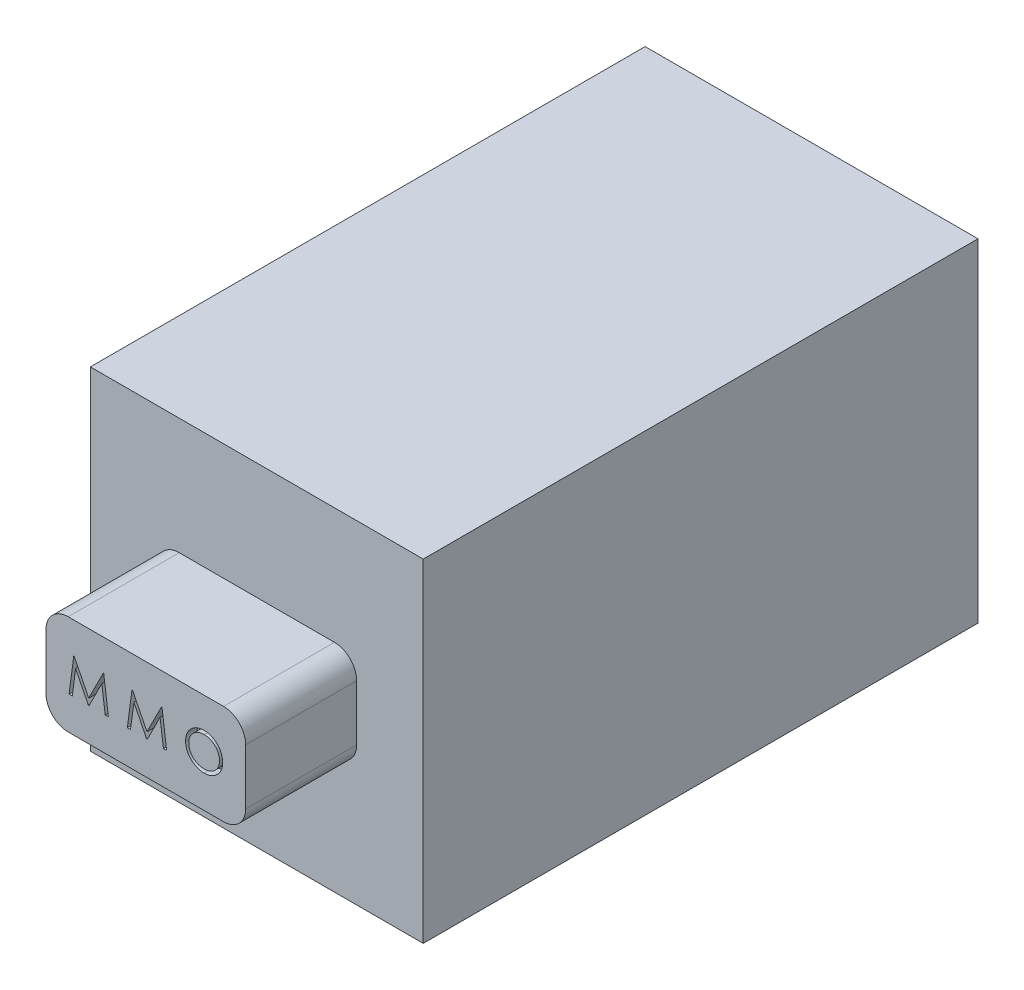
from build123d import *

# Parameters (mm, degrees)
ESQUISSE1_W             = 15
ESQUISSE1_H             = 15
BOSS_EXTRU_1_DEPTH      = 25
BOSS_EXTRU_2_DEPTH      = 5
ENL_V_MAT_EXTRU_1_DEPTH = 0.5


with BuildPart() as part:
    # Esquisse1 → Boss.-Extru.1 (new body)
    with BuildSketch(Plane.XY):
        Rectangle(ESQUISSE1_W, ESQUISSE1_H)
    extrude(amount=BOSS_EXTRU_1_DEPTH)

    # Esquisse2 → Boss.-Extru.2 (add)
    with BuildSketch(Plane.XY.offset(25)):
        with BuildLine():
            Line((-3.5, -2.25), (3.5, -2.25))
            ThreePointArc((3.5, -2.25), (4.207106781, -1.957106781), (4.5, -1.25))
            Line((4.5, -1.25), (4.5, 1.25))
            ThreePointArc((4.5, 1.25), (4.207106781, 1.957106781), (3.5, 2.25))
            Line((3.5, 2.25), (-3.5, 2.25))
            ThreePointArc((-3.5, 2.25), (-4.207106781, 1.957106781), (-4.5, 1.25))
            Line((-4.5, 1.25), (-4.5, -1.25))
            ThreePointArc((-4.5, -1.25), (-4.207106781, -1.957106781), (-3.5, -2.25))
        make_face()
    extrude(amount=BOSS_EXTRU_2_DEPTH)

    # Esquisse3 → Enl_v. mat.-Extru.1 (cut)
    # profile 1 of 3: a face of its own
    with BuildSketch(Plane.XY.offset(30)):
        Polygon((-1.689262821, -0.75), (-1.898830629, 0.8375), (-1.919183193, 0.8375), (-2.574599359, -0.465064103), (-3.228425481, 0.8375), (-3.249096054, 0.8375), (-3.459935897, -0.75), (-3.316831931, -0.75), (-3.164823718, 0.39228766), (-2.591771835, -0.75), (-2.559652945, -0.75), (-1.984375, 0.394831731), (-1.832684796, -0.75), align=None)
    # profile 2 of 3: a face of its own
    with BuildSketch(Plane.XY.offset(30)):
        Polygon((0.936217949, -0.75), (0.72665014, 0.8375), (0.706297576, 0.8375), (0.05088141, -0.465064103), (-0.602944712, 0.8375), (-0.623615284, 0.8375), (-0.834455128, -0.75), (-0.691351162, -0.75), (-0.539342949, 0.39228766), (0.033708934, -0.75), (0.065827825, -0.75), (0.641105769, 0.394831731), (0.792795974, -0.75), align=None)
    # profile 3 of 3: a face of its own
    with BuildSketch(Plane.XY.offset(30)):
        with BuildLine():
            add(Edge.make_bspline(
                [(2.635657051, 0.878205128), (2.606261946, 0.8774606), (2.548527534, 0.875998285), (2.463675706, 0.864804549), (2.382670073, 0.84543914), (2.30485076, 0.819647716), (2.231148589, 0.785242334), (2.161008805, 0.74365657), (2.094598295, 0.694454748), (2.032812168, 0.638017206), (1.976271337, 0.576611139), (1.926457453, 0.511080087), (1.884709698, 0.441820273), (1.850426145, 0.369039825), (1.82352999, 0.292903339), (1.804970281, 0.213004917), (1.793114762, 0.12986224), (1.791728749, 0.073153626), (1.791025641, 0.044386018)],
                knots=[0, 0, 0, 0, 1.065120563, 2.091984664, 3.0946048, 4.079830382, 5.057816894, 6.036188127, 7.030412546, 8.04752943, 9.064399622, 10.05169764, 11.02544977, 11.989514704, 12.962713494, 13.945757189, 14.957906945, 16, 16, 16, 16], degree=3))
            add(Edge.make_bspline(
                [(1.791025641, 0.044386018), (1.791728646, 0.015830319), (1.793114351, -0.040456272), (1.80498376, -0.123071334), (1.823598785, -0.202487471), (1.850176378, -0.278572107), (1.884296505, -0.351405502), (1.926322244, -0.420796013), (1.975825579, -0.486766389), (2.032162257, -0.548593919), (2.093576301, -0.605289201), (2.159448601, -0.654691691), (2.228297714, -0.697202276), (2.301009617, -0.731122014), (2.376619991, -0.758232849), (2.455805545, -0.776717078), (2.538195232, -0.788640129), (2.59437958, -0.790009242), (2.622936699, -0.790705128)],
                knots=[0, 0, 0, 0, 1.043624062, 2.057103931, 3.04512605, 4.022047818, 4.998200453, 5.980619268, 6.982898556, 8.009068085, 9.034988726, 10.034168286, 11.015286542, 11.987931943, 12.962482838, 13.94673481, 14.956375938, 16, 16, 16, 16], degree=3))
            add(Edge.make_bspline(
                [(2.622936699, -0.790705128), (2.651704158, -0.790002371), (2.708412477, -0.788617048), (2.791659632, -0.776741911), (2.87161418, -0.758172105), (2.948047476, -0.731633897), (3.02100214, -0.697336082), (3.090620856, -0.65551481), (3.156624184, -0.605890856), (3.218464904, -0.549572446), (3.275047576, -0.488262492), (3.324377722, -0.422569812), (3.366208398, -0.35378323), (3.400391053, -0.281711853), (3.427453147, -0.206704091), (3.445915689, -0.128259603), (3.457860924, -0.046825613), (3.459237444, 0.008620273), (3.459935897, 0.036753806)],
                knots=[0, 0, 0, 0, 1.053102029, 2.075944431, 3.073151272, 4.055350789, 5.033113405, 6.020478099, 7.024410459, 8.052272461, 9.079885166, 10.07527673, 11.055994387, 12.023226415, 12.992069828, 13.970394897, 14.97016774, 16, 16, 16, 16], degree=3))
            add(Edge.make_bspline(
                [(3.459935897, 0.036753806), (3.459693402, 0.055637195), (3.45921147, 0.093165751), (3.453409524, 0.148894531), (3.444990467, 0.203727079), (3.432924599, 0.257507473), (3.417144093, 0.310104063), (3.398524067, 0.361879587), (3.375782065, 0.412309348), (3.350073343, 0.461632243), (3.321379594, 0.509079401), (3.289685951, 0.553928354), (3.256105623, 0.596555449), (3.219292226, 0.635856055), (3.180459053, 0.672973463), (3.138976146, 0.707337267), (3.095096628, 0.739257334), (3.048631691, 0.768022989), (3.00072626, 0.794039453), (2.951342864, 0.816365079), (2.901152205, 0.835526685), (2.849919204, 0.851057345), (2.797779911, 0.863318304), (2.74462053, 0.871667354), (2.690483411, 0.877484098), (2.654011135, 0.877963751), (2.635657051, 0.878205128)],
                knots=[0, 0, 0, 0, 1.037015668, 2.060948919, 3.074880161, 4.083647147, 5.086022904, 6.090072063, 7.104153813, 8.122640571, 9.144368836, 10.147691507, 11.138137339, 12.123020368, 13.103399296, 14.087645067, 15.080126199, 16.082011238, 17.087798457, 18.072939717, 19.057185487, 20.037253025, 21.01195951, 21.997135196, 22.992090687, 24, 24, 24, 24], degree=3))
        make_face()
        with BuildLine():
            add(Edge.make_bspline(
                [(2.628660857, 0.715384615), (2.643726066, 0.715200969), (2.673712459, 0.714835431), (2.718291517, 0.710020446), (2.762284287, 0.70315796), (2.805699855, 0.693369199), (2.848356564, 0.680032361), (2.890652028, 0.664683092), (2.932200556, 0.645986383), (2.972864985, 0.624862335), (3.012287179, 0.601481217), (3.049485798, 0.575640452), (3.08455714, 0.547946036), (3.117415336, 0.518333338), (3.147963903, 0.486651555), (3.176804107, 0.453380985), (3.202779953, 0.417570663), (3.226585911, 0.380191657), (3.247889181, 0.341292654), (3.266832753, 0.301283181), (3.282328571, 0.259836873), (3.294966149, 0.21740338), (3.305443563, 0.174049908), (3.312081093, 0.129447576), (3.316948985, 0.083820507), (3.317293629, 0.052985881), (3.317467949, 0.037389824)],
                knots=[0, 0, 0, 0, 1.008559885, 2.007477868, 2.99961109, 3.989939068, 4.984837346, 5.991145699, 7.001802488, 8.033829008, 9.059044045, 10.069351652, 11.065060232, 12.050310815, 13.029377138, 14.011219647, 14.996725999, 15.989392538, 16.977580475, 17.965360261, 18.951710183, 19.937753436, 20.929683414, 21.935841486, 22.955955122, 24, 24, 24, 24], degree=3))
            add(Edge.make_bspline(
                [(3.317467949, 0.037389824), (3.316889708, 0.014456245), (3.315752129, -0.030661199), (3.305792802, -0.096777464), (3.290452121, -0.160317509), (3.267838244, -0.22093366), (3.239557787, -0.27914696), (3.20462059, -0.334440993), (3.163228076, -0.386830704), (3.116209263, -0.435950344), (3.064809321, -0.480783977), (3.010229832, -0.52013738), (2.953055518, -0.553434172), (2.893137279, -0.580560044), (2.830795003, -0.602054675), (2.765626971, -0.616786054), (2.698067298, -0.62648135), (2.652015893, -0.627412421), (2.628660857, -0.627884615)],
                knots=[0, 0, 0, 0, 1.032063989, 2.030389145, 3.003944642, 3.970395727, 4.937377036, 5.913328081, 6.909231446, 7.93887556, 8.970685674, 9.976071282, 10.964166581, 11.944589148, 12.933237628, 13.927779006, 14.949070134, 16, 16, 16, 16], degree=3))
            add(Edge.make_bspline(
                [(2.628660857, -0.627884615), (2.612962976, -0.62766894), (2.581829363, -0.627241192), (2.535521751, -0.622932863), (2.490048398, -0.616024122), (2.445473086, -0.606077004), (2.401846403, -0.593627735), (2.35898626, -0.578837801), (2.317349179, -0.560385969), (2.276409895, -0.539998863), (2.237223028, -0.516757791), (2.199814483, -0.491794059), (2.165127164, -0.464140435), (2.132293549, -0.434967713), (2.101619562, -0.403687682), (2.07331263, -0.37034101), (2.04746807, -0.334717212), (2.023671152, -0.297394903), (2.002442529, -0.258389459), (1.983946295, -0.218234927), (1.968254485, -0.177030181), (1.955586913, -0.134715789), (1.945660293, -0.091372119), (1.938820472, -0.046941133), (1.934036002, -0.001511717), (1.933675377, 0.02921496), (1.93349359, 0.044704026)],
                knots=[0, 0, 0, 0, 1.047197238, 2.076906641, 3.100256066, 4.114471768, 5.12198147, 6.126382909, 7.136867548, 8.15857795, 9.17633901, 10.174870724, 11.156907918, 12.133735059, 13.104061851, 14.077631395, 15.04955518, 16.038496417, 17.029181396, 18.010275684, 18.986308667, 19.968651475, 20.955262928, 21.950658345, 22.966943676, 24, 24, 24, 24], degree=3))
            add(Edge.make_bspline(
                [(1.93349359, 0.044704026), (1.933675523, 0.06008713), (1.934036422, 0.09060235), (1.938818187, 0.135714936), (1.945667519, 0.179826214), (1.955538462, 0.22276301), (1.96826121, 0.26453627), (1.983949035, 0.305106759), (2.002448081, 0.344625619), (2.023678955, 0.382995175), (2.047543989, 0.419813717), (2.073621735, 0.455011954), (2.102362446, 0.487928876), (2.132944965, 0.519377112), (2.166133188, 0.54868594), (2.201776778, 0.575865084), (2.239443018, 0.601570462), (2.2793243, 0.624759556), (2.320483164, 0.646174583), (2.362716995, 0.664522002), (2.405547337, 0.680112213), (2.448865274, 0.693409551), (2.49303541, 0.703119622), (2.53775929, 0.71002663), (2.582975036, 0.714833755), (2.613383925, 0.715200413), (2.628660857, 0.715384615)],
                knots=[0, 0, 0, 0, 1.02996197, 2.043119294, 3.035359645, 4.018872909, 4.991431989, 5.957985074, 6.929999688, 7.912076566, 8.892894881, 9.867085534, 10.843653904, 11.817741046, 12.803660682, 13.806313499, 14.818574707, 15.856120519, 16.894564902, 17.924820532, 18.937903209, 19.946497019, 20.957711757, 21.963978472, 22.977135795, 24, 24, 24, 24], degree=3))
        make_face(mode=Mode.SUBTRACT)
    extrude(amount=-ENL_V_MAT_EXTRU_1_DEPTH, mode=Mode.SUBTRACT)


solid = part.part
